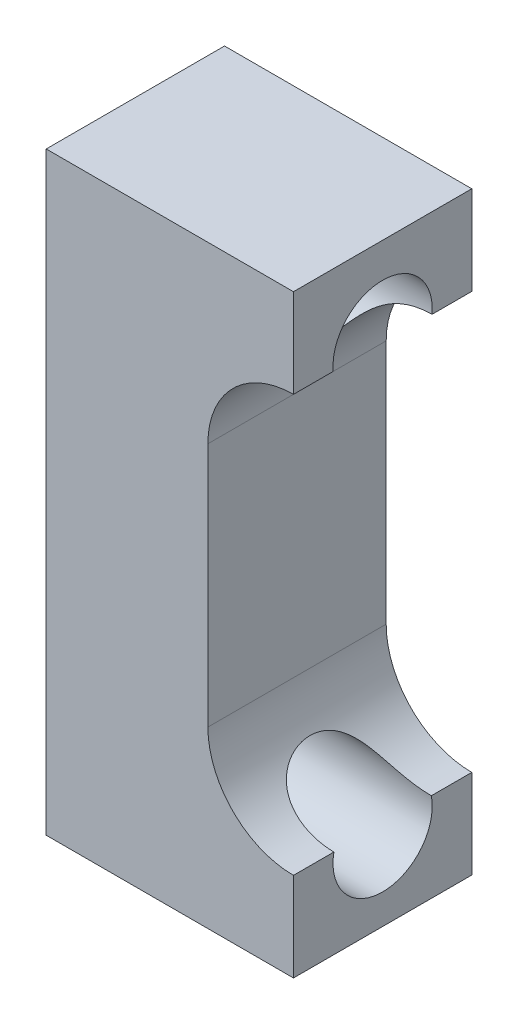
from build123d import *

# Parameters (mm, degrees)
BOSS_EXTRUDE1_DEPTH      = 4.7625
M5_CLEARANCE_HOLE1_D     = 5.3
M5_CLEARANCE_HOLE1_DEPTH = 25.4
M5_CLEARANCE_HOLE1_TIP   = 1.59228064
CUT_EXTRUDE3_DEPTH       = 23.152327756


with BuildPart() as part:
    # Sketch1 → Boss-Extrude1 (new, symmetric)
    with BuildSketch(Plane.XY):
        Polygon((0, 16), (-1.208, 16), (-1.208, -15.75), (0, -15.75), (12, -15.75), (12, 16), align=None)
    extrude(amount=BOSS_EXTRUDE1_DEPTH, both=True)

    # M5 Clearance Hole1
    with Locations(Plane(origin=(-13.4, 11.5, 0), x_dir=(0, -1, 0), z_dir=(-1, 0, 0))):
        with Locations((0, 0), (23, 0)):
            Hole(M5_CLEARANCE_HOLE1_D / 2, depth=M5_CLEARANCE_HOLE1_DEPTH)
            with Locations((0, 0, -(M5_CLEARANCE_HOLE1_DEPTH + M5_CLEARANCE_HOLE1_TIP / 2))):  # 118° drill point
                Cone(0, M5_CLEARANCE_HOLE1_D / 2, M5_CLEARANCE_HOLE1_TIP, mode=Mode.SUBTRACT)

    # Sketch6 → Cut-Extrude3 (cut, through all)
    with BuildSketch(Plane.XY.offset(4.7625)):
        with BuildLine():
            Line((12, 11.2502), (19.954813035, 11.2502))
            Line((19.954813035, 11.2502), (19.954813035, -11.0002))
            Line((19.954813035, -11.0002), (12, -11.0002))
            ThreePointArc((12, -11.0002), (8.767107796, -9.661092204), (7.428, -6.4282))
            Line((7.428, -6.4282), (7.428, 6.6782))
            ThreePointArc((7.428, 6.6782), (8.767107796, 9.911092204), (12, 11.2502))
        make_face()
    extrude(amount=-CUT_EXTRUDE3_DEPTH, mode=Mode.SUBTRACT)


solid = part.part
